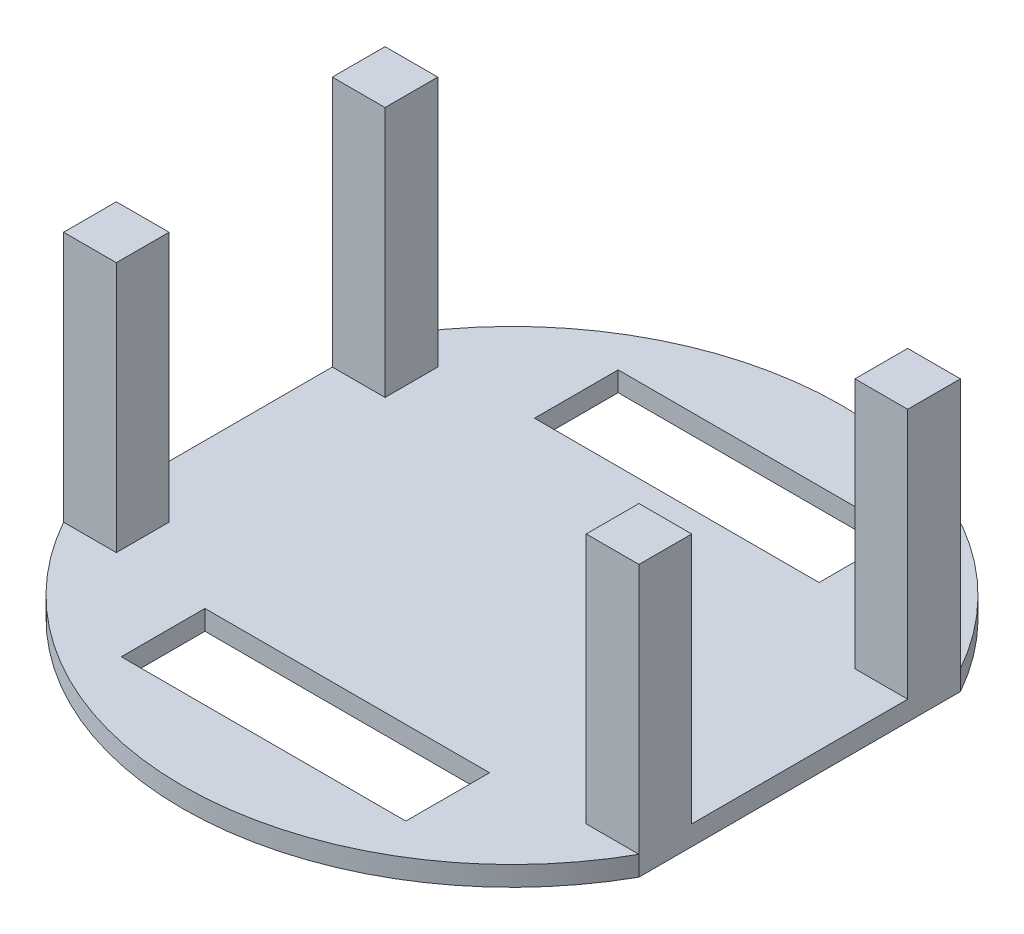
ISO-10303-21;
HEADER;
FILE_DESCRIPTION(('STEP AP214'),'2;1');
FILE_NAME('part.step','',(''),(''),'','','');
FILE_SCHEMA(('AUTOMOTIVE_DESIGN { 1 0 10303 214 1 1 1 1 }'));
ENDSEC;
DATA;
#1=APPLICATION_CONTEXT('core data for automotive mechanical design processes');
#2=APPLICATION_PROTOCOL_DEFINITION('international standard','automotive_design',2000,#1);
#3=PRODUCT_CONTEXT('',#1,'mechanical');
#4=PRODUCT('Part','Part','',(#3));
#5=PRODUCT_RELATED_PRODUCT_CATEGORY('part','',(#4));
#6=PRODUCT_DEFINITION_FORMATION('','',#4);
#7=PRODUCT_DEFINITION_CONTEXT('part definition',#1,'design');
#8=PRODUCT_DEFINITION('design','',#6,#7);
#9=PRODUCT_DEFINITION_SHAPE('','',#8);
#10=(LENGTH_UNIT() NAMED_UNIT(*) SI_UNIT(.MILLI.,.METRE.));
#11=(NAMED_UNIT(*) PLANE_ANGLE_UNIT() SI_UNIT($,.RADIAN.));
#12=(NAMED_UNIT(*) SI_UNIT($,.STERADIAN.) SOLID_ANGLE_UNIT());
#13=UNCERTAINTY_MEASURE_WITH_UNIT(LENGTH_MEASURE(1.E-05),#10,'distance_accuracy_value','');
#14=(GEOMETRIC_REPRESENTATION_CONTEXT(3) GLOBAL_UNCERTAINTY_ASSIGNED_CONTEXT((#13)) GLOBAL_UNIT_ASSIGNED_CONTEXT((#10,
#11,#12)) REPRESENTATION_CONTEXT('',''));
#15=CARTESIAN_POINT('',(0.,0.,0.));
#16=DIRECTION('',(0.,0.,1.));
#17=DIRECTION('',(1.,0.,0.));
#18=AXIS2_PLACEMENT_3D('',#15,#16,#17);
#19=CARTESIAN_POINT('',(0.,3.,0.));
#20=DIRECTION('',(0.,1.,0.));
#21=DIRECTION('',(0.,0.,1.));
#22=AXIS2_PLACEMENT_3D('',#19,#20,#21);
#23=PLANE('',#22);
#24=DIRECTION('',(1.,0.,0.));
#25=VECTOR('',#24,1.);
#26=CARTESIAN_POINT('',(0.,3.,25.));
#27=LINE('',#26,#25);
#28=CARTESIAN_POINT('',(-21.59,3.,25.));
#29=VERTEX_POINT('',#28);
#30=CARTESIAN_POINT('',(21.59,3.,25.));
#31=VERTEX_POINT('',#30);
#32=EDGE_CURVE('E223',#29,#31,#27,.T.);
#33=ORIENTED_EDGE('',*,*,#32,.T.);
#34=DIRECTION('',(0.,0.,1.));
#35=VECTOR('',#34,1.);
#36=CARTESIAN_POINT('',(21.59,3.,25.));
#37=LINE('',#36,#35);
#38=CARTESIAN_POINT('',(21.59,3.,37.7));
#39=VERTEX_POINT('',#38);
#40=EDGE_CURVE('E210',#31,#39,#37,.T.);
#41=ORIENTED_EDGE('',*,*,#40,.T.);
#42=DIRECTION('',(-1.,0.,0.));
#43=VECTOR('',#42,1.);
#44=CARTESIAN_POINT('',(21.59,3.,37.7));
#45=LINE('',#44,#43);
#46=CARTESIAN_POINT('',(-21.59,3.,37.7));
#47=VERTEX_POINT('',#46);
#48=EDGE_CURVE('E240',#39,#47,#45,.T.);
#49=ORIENTED_EDGE('',*,*,#48,.T.);
#50=DIRECTION('',(0.,0.,-1.));
#51=VECTOR('',#50,1.);
#52=CARTESIAN_POINT('',(-21.59,3.,37.7));
#53=LINE('',#52,#51);
#54=EDGE_CURVE('E230',#47,#29,#53,.T.);
#55=ORIENTED_EDGE('',*,*,#54,.T.);
#56=EDGE_LOOP('',(#33,#41,#49,#55));
#57=FACE_BOUND('',#56,.T.);
#58=DIRECTION('',(0.,0.,-1.));
#59=VECTOR('',#58,1.);
#60=CARTESIAN_POINT('',(-21.59,3.,-37.7));
#61=LINE('',#60,#59);
#62=CARTESIAN_POINT('',(-21.59,3.,-25.));
#63=VERTEX_POINT('',#62);
#64=CARTESIAN_POINT('',(-21.59,3.,-37.7));
#65=VERTEX_POINT('',#64);
#66=EDGE_CURVE('E252',#63,#65,#61,.T.);
#67=ORIENTED_EDGE('',*,*,#66,.T.);
#68=DIRECTION('',(1.,0.,0.));
#69=VECTOR('',#68,1.);
#70=CARTESIAN_POINT('',(21.59,3.,-37.7));
#71=LINE('',#70,#69);
#72=CARTESIAN_POINT('',(21.59,3.,-37.7));
#73=VERTEX_POINT('',#72);
#74=EDGE_CURVE('E269',#65,#73,#71,.T.);
#75=ORIENTED_EDGE('',*,*,#74,.T.);
#76=DIRECTION('',(0.,0.,1.));
#77=VECTOR('',#76,1.);
#78=CARTESIAN_POINT('',(21.59,3.,-25.));
#79=LINE('',#78,#77);
#80=CARTESIAN_POINT('',(21.59,3.,-25.));
#81=VERTEX_POINT('',#80);
#82=EDGE_CURVE('E265',#73,#81,#79,.T.);
#83=ORIENTED_EDGE('',*,*,#82,.T.);
#84=DIRECTION('',(-1.,0.,0.));
#85=VECTOR('',#84,1.);
#86=CARTESIAN_POINT('',(0.,3.,-25.));
#87=LINE('',#86,#85);
#88=EDGE_CURVE('E261',#81,#63,#87,.T.);
#89=ORIENTED_EDGE('',*,*,#88,.T.);
#90=EDGE_LOOP('',(#67,#75,#83,#89));
#91=FACE_BOUND('',#90,.T.);
#92=DIRECTION('',(0.,0.,-1.));
#93=VECTOR('',#92,1.);
#94=CARTESIAN_POINT('',(-35.65,3.,24.3860103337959));
#95=LINE('',#94,#93);
#96=CARTESIAN_POINT('',(-35.65,3.,24.3860103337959));
#97=VERTEX_POINT('',#96);
#98=CARTESIAN_POINT('',(-35.65,3.,16.3860103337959));
#99=VERTEX_POINT('',#98);
#100=EDGE_CURVE('E290',#97,#99,#95,.T.);
#101=ORIENTED_EDGE('',*,*,#100,.F.);
#102=DIRECTION('',(1.,0.,0.));
#103=VECTOR('',#102,1.);
#104=CARTESIAN_POINT('',(-43.65,3.,24.3860103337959));
#105=LINE('',#104,#103);
#106=CARTESIAN_POINT('',(-43.65,3.,24.3860103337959));
#107=VERTEX_POINT('',#106);
#108=EDGE_CURVE('E288',#107,#97,#105,.T.);
#109=ORIENTED_EDGE('',*,*,#108,.F.);
#110=CARTESIAN_POINT('',(0.,3.,0.));
#111=DIRECTION('',(0.,1.,0.));
#112=DIRECTION('',(0.,0.,1.));
#113=AXIS2_PLACEMENT_3D('',#110,#111,#112);
#114=CIRCLE('',#113,50.);
#115=CARTESIAN_POINT('',(43.65,3.,24.3860103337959));
#116=VERTEX_POINT('',#115);
#117=EDGE_CURVE('E406',#107,#116,#114,.T.);
#118=ORIENTED_EDGE('',*,*,#117,.T.);
#119=DIRECTION('',(-1.,0.,0.));
#120=VECTOR('',#119,1.);
#121=CARTESIAN_POINT('',(43.65,3.,24.3860103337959));
#122=LINE('',#121,#120);
#123=CARTESIAN_POINT('',(35.65,3.,24.3860103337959));
#124=VERTEX_POINT('',#123);
#125=EDGE_CURVE('E322',#116,#124,#122,.T.);
#126=ORIENTED_EDGE('',*,*,#125,.T.);
#127=DIRECTION('',(0.,0.,-1.));
#128=VECTOR('',#127,1.);
#129=CARTESIAN_POINT('',(35.65,3.,24.3860103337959));
#130=LINE('',#129,#128);
#131=CARTESIAN_POINT('',(35.65,3.,16.3860103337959));
#132=VERTEX_POINT('',#131);
#133=EDGE_CURVE('E318',#124,#132,#130,.T.);
#134=ORIENTED_EDGE('',*,*,#133,.T.);
#135=DIRECTION('',(-1.,0.,0.));
#136=VECTOR('',#135,1.);
#137=CARTESIAN_POINT('',(43.65,3.,16.3860103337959));
#138=LINE('',#137,#136);
#139=CARTESIAN_POINT('',(43.65,3.,16.3860103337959));
#140=VERTEX_POINT('',#139);
#141=EDGE_CURVE('E315',#140,#132,#138,.T.);
#142=ORIENTED_EDGE('',*,*,#141,.F.);
#143=DIRECTION('',(0.,0.,1.));
#144=VECTOR('',#143,1.);
#145=CARTESIAN_POINT('',(43.65,3.,41.6852732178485));
#146=LINE('',#145,#144);
#147=CARTESIAN_POINT('',(43.65,3.,-16.3860103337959));
#148=VERTEX_POINT('',#147);
#149=EDGE_CURVE('E389',#148,#140,#146,.T.);
#150=ORIENTED_EDGE('',*,*,#149,.F.);
#151=DIRECTION('',(1.,0.,0.));
#152=VECTOR('',#151,1.);
#153=CARTESIAN_POINT('',(0.,3.,-16.3860103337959));
#154=LINE('',#153,#152);
#155=CARTESIAN_POINT('',(35.65,3.,-16.3860103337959));
#156=VERTEX_POINT('',#155);
#157=EDGE_CURVE('E343',#156,#148,#154,.T.);
#158=ORIENTED_EDGE('',*,*,#157,.F.);
#159=DIRECTION('',(0.,0.,1.));
#160=VECTOR('',#159,1.);
#161=CARTESIAN_POINT('',(35.65,3.,0.));
#162=LINE('',#161,#160);
#163=CARTESIAN_POINT('',(35.65,3.,-24.3860103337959));
#164=VERTEX_POINT('',#163);
#165=EDGE_CURVE('E346',#164,#156,#162,.T.);
#166=ORIENTED_EDGE('',*,*,#165,.F.);
#167=DIRECTION('',(-1.,0.,0.));
#168=VECTOR('',#167,1.);
#169=CARTESIAN_POINT('',(0.,3.,-24.3860103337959));
#170=LINE('',#169,#168);
#171=CARTESIAN_POINT('',(43.65,3.,-24.3860103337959));
#172=VERTEX_POINT('',#171);
#173=EDGE_CURVE('E349',#172,#164,#170,.T.);
#174=ORIENTED_EDGE('',*,*,#173,.F.);
#175=CARTESIAN_POINT('',(-43.65,3.,-24.3860103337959));
#176=VERTEX_POINT('',#175);
#177=EDGE_CURVE('E409',#172,#176,#114,.T.);
#178=ORIENTED_EDGE('',*,*,#177,.T.);
#179=DIRECTION('',(1.,0.,0.));
#180=VECTOR('',#179,1.);
#181=CARTESIAN_POINT('',(0.,3.,-24.3860103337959));
#182=LINE('',#181,#180);
#183=CARTESIAN_POINT('',(-35.65,3.,-24.3860103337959));
#184=VERTEX_POINT('',#183);
#185=EDGE_CURVE('E374',#176,#184,#182,.T.);
#186=ORIENTED_EDGE('',*,*,#185,.T.);
#187=DIRECTION('',(0.,0.,1.));
#188=VECTOR('',#187,1.);
#189=CARTESIAN_POINT('',(-35.65,3.,0.));
#190=LINE('',#189,#188);
#191=CARTESIAN_POINT('',(-35.65,3.,-16.3860103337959));
#192=VERTEX_POINT('',#191);
#193=EDGE_CURVE('E352',#184,#192,#190,.T.);
#194=ORIENTED_EDGE('',*,*,#193,.T.);
#195=DIRECTION('',(1.,0.,0.));
#196=VECTOR('',#195,1.);
#197=CARTESIAN_POINT('',(0.,3.,-16.3860103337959));
#198=LINE('',#197,#196);
#199=CARTESIAN_POINT('',(-43.65,3.,-16.3860103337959));
#200=VERTEX_POINT('',#199);
#201=EDGE_CURVE('E364',#200,#192,#198,.T.);
#202=ORIENTED_EDGE('',*,*,#201,.F.);
#203=DIRECTION('',(0.,0.,-1.));
#204=VECTOR('',#203,1.);
#205=CARTESIAN_POINT('',(-43.65,3.,0.));
#206=LINE('',#205,#204);
#207=CARTESIAN_POINT('',(-43.65,3.,16.3860103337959));
#208=VERTEX_POINT('',#207);
#209=EDGE_CURVE('E388',#208,#200,#206,.T.);
#210=ORIENTED_EDGE('',*,*,#209,.F.);
#211=DIRECTION('',(1.,0.,0.));
#212=VECTOR('',#211,1.);
#213=CARTESIAN_POINT('',(-43.65,3.,16.3860103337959));
#214=LINE('',#213,#212);
#215=EDGE_CURVE('E294',#208,#99,#214,.T.);
#216=ORIENTED_EDGE('',*,*,#215,.T.);
#217=EDGE_LOOP('',(#101,#109,#118,#126,#134,#142,#150,#158,#166,#174,#178,#186,#194,#202,#210,#216));
#218=FACE_BOUND('',#217,.T.);
#219=ADVANCED_FACE('F37',(#57,#91,#218),#23,.T.);
#220=CARTESIAN_POINT('',(0.,3.,0.));
#221=DIRECTION('',(0.,-1.,0.));
#222=DIRECTION('',(0.,0.,-1.));
#223=AXIS2_PLACEMENT_3D('',#220,#221,#222);
#224=CYLINDRICAL_SURFACE('',#223,50.);
#225=ORIENTED_EDGE('',*,*,#177,.F.);
#226=DIRECTION('',(0.,-1.,0.));
#227=VECTOR('',#226,1.);
#228=CARTESIAN_POINT('',(43.65,3.,-24.3860103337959));
#229=LINE('',#228,#227);
#230=CARTESIAN_POINT('',(43.65,0.,-24.3860103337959));
#231=VERTEX_POINT('',#230);
#232=EDGE_CURVE('E402',#172,#231,#229,.T.);
#233=ORIENTED_EDGE('',*,*,#232,.T.);
#234=CARTESIAN_POINT('',(0.,0.,0.));
#235=DIRECTION('',(0.,1.,0.));
#236=DIRECTION('',(0.,0.,1.));
#237=AXIS2_PLACEMENT_3D('',#234,#235,#236);
#238=CIRCLE('',#237,50.);
#239=CARTESIAN_POINT('',(-43.65,0.,-24.3860103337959));
#240=VERTEX_POINT('',#239);
#241=EDGE_CURVE('E410',#231,#240,#238,.T.);
#242=ORIENTED_EDGE('',*,*,#241,.T.);
#243=DIRECTION('',(0.,-1.,0.));
#244=VECTOR('',#243,1.);
#245=CARTESIAN_POINT('',(-43.65,3.,-24.3860103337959));
#246=LINE('',#245,#244);
#247=EDGE_CURVE('E392',#240,#176,#246,.F.);
#248=ORIENTED_EDGE('',*,*,#247,.T.);
#249=EDGE_LOOP('',(#225,#233,#242,#248));
#250=FACE_BOUND('',#249,.T.);
#251=ADVANCED_FACE('F426',(#250),#224,.T.);
#252=CARTESIAN_POINT('',(-43.65,0.,24.3860103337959));
#253=VERTEX_POINT('',#252);
#254=CARTESIAN_POINT('',(43.65,0.,24.3860103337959));
#255=VERTEX_POINT('',#254);
#256=EDGE_CURVE('E405',#253,#255,#238,.T.);
#257=ORIENTED_EDGE('',*,*,#256,.T.);
#258=DIRECTION('',(0.,-1.,0.));
#259=VECTOR('',#258,1.);
#260=CARTESIAN_POINT('',(43.65,3.,24.3860103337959));
#261=LINE('',#260,#259);
#262=EDGE_CURVE('E399',#255,#116,#261,.F.);
#263=ORIENTED_EDGE('',*,*,#262,.T.);
#264=ORIENTED_EDGE('',*,*,#117,.F.);
#265=DIRECTION('',(0.,-1.,0.));
#266=VECTOR('',#265,1.);
#267=CARTESIAN_POINT('',(-43.65,3.,24.3860103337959));
#268=LINE('',#267,#266);
#269=EDGE_CURVE('E396',#107,#253,#268,.T.);
#270=ORIENTED_EDGE('',*,*,#269,.T.);
#271=EDGE_LOOP('',(#257,#263,#264,#270));
#272=FACE_BOUND('',#271,.T.);
#273=ADVANCED_FACE('F39',(#272),#224,.T.);
#274=CARTESIAN_POINT('',(0.,0.,0.));
#275=DIRECTION('',(0.,1.,0.));
#276=DIRECTION('',(0.,0.,1.));
#277=AXIS2_PLACEMENT_3D('',#274,#275,#276);
#278=PLANE('',#277);
#279=DIRECTION('',(0.,0.,1.));
#280=VECTOR('',#279,1.);
#281=CARTESIAN_POINT('',(21.59,0.,25.));
#282=LINE('',#281,#280);
#283=CARTESIAN_POINT('',(21.59,0.,25.));
#284=VERTEX_POINT('',#283);
#285=CARTESIAN_POINT('',(21.59,0.,37.7));
#286=VERTEX_POINT('',#285);
#287=EDGE_CURVE('E233',#284,#286,#282,.T.);
#288=ORIENTED_EDGE('',*,*,#287,.F.);
#289=DIRECTION('',(1.,0.,0.));
#290=VECTOR('',#289,1.);
#291=CARTESIAN_POINT('',(0.,0.,25.));
#292=LINE('',#291,#290);
#293=CARTESIAN_POINT('',(-21.59,0.,25.));
#294=VERTEX_POINT('',#293);
#295=EDGE_CURVE('E226',#294,#284,#292,.T.);
#296=ORIENTED_EDGE('',*,*,#295,.F.);
#297=DIRECTION('',(0.,0.,-1.));
#298=VECTOR('',#297,1.);
#299=CARTESIAN_POINT('',(-21.59,0.,37.7));
#300=LINE('',#299,#298);
#301=CARTESIAN_POINT('',(-21.59,0.,37.7));
#302=VERTEX_POINT('',#301);
#303=EDGE_CURVE('E277',#302,#294,#300,.T.);
#304=ORIENTED_EDGE('',*,*,#303,.F.);
#305=DIRECTION('',(-1.,0.,0.));
#306=VECTOR('',#305,1.);
#307=CARTESIAN_POINT('',(21.59,0.,37.7));
#308=LINE('',#307,#306);
#309=EDGE_CURVE('E231',#286,#302,#308,.T.);
#310=ORIENTED_EDGE('',*,*,#309,.F.);
#311=EDGE_LOOP('',(#288,#296,#304,#310));
#312=FACE_BOUND('',#311,.T.);
#313=DIRECTION('',(1.,0.,0.));
#314=VECTOR('',#313,1.);
#315=CARTESIAN_POINT('',(21.59,0.,-37.7));
#316=LINE('',#315,#314);
#317=CARTESIAN_POINT('',(-21.59,0.,-37.7));
#318=VERTEX_POINT('',#317);
#319=CARTESIAN_POINT('',(21.59,0.,-37.7));
#320=VERTEX_POINT('',#319);
#321=EDGE_CURVE('E253',#318,#320,#316,.T.);
#322=ORIENTED_EDGE('',*,*,#321,.F.);
#323=DIRECTION('',(0.,0.,-1.));
#324=VECTOR('',#323,1.);
#325=CARTESIAN_POINT('',(-21.59,0.,-37.7));
#326=LINE('',#325,#324);
#327=CARTESIAN_POINT('',(-21.59,0.,-25.));
#328=VERTEX_POINT('',#327);
#329=EDGE_CURVE('E249',#328,#318,#326,.T.);
#330=ORIENTED_EDGE('',*,*,#329,.F.);
#331=DIRECTION('',(-1.,0.,0.));
#332=VECTOR('',#331,1.);
#333=CARTESIAN_POINT('',(0.,0.,-25.));
#334=LINE('',#333,#332);
#335=CARTESIAN_POINT('',(21.59,0.,-25.));
#336=VERTEX_POINT('',#335);
#337=EDGE_CURVE('E247',#336,#328,#334,.T.);
#338=ORIENTED_EDGE('',*,*,#337,.F.);
#339=DIRECTION('',(0.,0.,1.));
#340=VECTOR('',#339,1.);
#341=CARTESIAN_POINT('',(21.59,0.,-25.));
#342=LINE('',#341,#340);
#343=EDGE_CURVE('E250',#320,#336,#342,.T.);
#344=ORIENTED_EDGE('',*,*,#343,.F.);
#345=EDGE_LOOP('',(#322,#330,#338,#344));
#346=FACE_BOUND('',#345,.T.);
#347=ORIENTED_EDGE('',*,*,#241,.F.);
#348=DIRECTION('',(0.,0.,1.));
#349=VECTOR('',#348,1.);
#350=CARTESIAN_POINT('',(43.65,0.,0.));
#351=LINE('',#350,#349);
#352=EDGE_CURVE('E11',#231,#255,#351,.T.);
#353=ORIENTED_EDGE('',*,*,#352,.T.);
#354=ORIENTED_EDGE('',*,*,#256,.F.);
#355=DIRECTION('',(0.,0.,-1.));
#356=VECTOR('',#355,1.);
#357=CARTESIAN_POINT('',(-43.65,0.,0.));
#358=LINE('',#357,#356);
#359=EDGE_CURVE('E45',#253,#240,#358,.T.);
#360=ORIENTED_EDGE('',*,*,#359,.T.);
#361=EDGE_LOOP('',(#347,#353,#354,#360));
#362=FACE_BOUND('',#361,.T.);
#363=ADVANCED_FACE('F465',(#312,#346,#362),#278,.F.);
#364=CARTESIAN_POINT('',(-43.65,-101.379189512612,0.));
#365=DIRECTION('',(1.,0.,0.));
#366=DIRECTION('',(0.,0.,-1.));
#367=AXIS2_PLACEMENT_3D('',#364,#365,#366);
#368=PLANE('',#367);
#369=ORIENTED_EDGE('',*,*,#269,.F.);
#370=DIRECTION('',(0.,-1.,0.));
#371=VECTOR('',#370,1.);
#372=CARTESIAN_POINT('',(-43.65,41.1,24.3860103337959));
#373=LINE('',#372,#371);
#374=CARTESIAN_POINT('',(-43.65,41.1,24.3860103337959));
#375=VERTEX_POINT('',#374);
#376=EDGE_CURVE('E243',#375,#107,#373,.T.);
#377=ORIENTED_EDGE('',*,*,#376,.F.);
#378=DIRECTION('',(0.,0.,-1.));
#379=VECTOR('',#378,1.);
#380=CARTESIAN_POINT('',(-43.65,41.1,24.3860103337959));
#381=LINE('',#380,#379);
#382=CARTESIAN_POINT('',(-43.65,41.1,16.3860103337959));
#383=VERTEX_POINT('',#382);
#384=EDGE_CURVE('E291',#375,#383,#381,.T.);
#385=ORIENTED_EDGE('',*,*,#384,.T.);
#386=DIRECTION('',(0.,-1.,0.));
#387=VECTOR('',#386,1.);
#388=CARTESIAN_POINT('',(-43.65,41.1,16.3860103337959));
#389=LINE('',#388,#387);
#390=EDGE_CURVE('E278',#383,#208,#389,.T.);
#391=ORIENTED_EDGE('',*,*,#390,.T.);
#392=ORIENTED_EDGE('',*,*,#209,.T.);
#393=DIRECTION('',(0.,-1.,0.));
#394=VECTOR('',#393,1.);
#395=CARTESIAN_POINT('',(-43.65,41.1,-16.3860103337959));
#396=LINE('',#395,#394);
#397=CARTESIAN_POINT('',(-43.65,41.1,-16.3860103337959));
#398=VERTEX_POINT('',#397);
#399=EDGE_CURVE('E380',#398,#200,#396,.T.);
#400=ORIENTED_EDGE('',*,*,#399,.F.);
#401=DIRECTION('',(0.,0.,1.));
#402=VECTOR('',#401,1.);
#403=CARTESIAN_POINT('',(-43.65,41.1,0.));
#404=LINE('',#403,#402);
#405=CARTESIAN_POINT('',(-43.65,41.1,-24.3860103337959));
#406=VERTEX_POINT('',#405);
#407=EDGE_CURVE('E367',#406,#398,#404,.T.);
#408=ORIENTED_EDGE('',*,*,#407,.F.);
#409=DIRECTION('',(0.,-1.,0.));
#410=VECTOR('',#409,1.);
#411=CARTESIAN_POINT('',(-43.65,41.1,-24.3860103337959));
#412=LINE('',#411,#410);
#413=EDGE_CURVE('E383',#406,#176,#412,.T.);
#414=ORIENTED_EDGE('',*,*,#413,.T.);
#415=ORIENTED_EDGE('',*,*,#247,.F.);
#416=ORIENTED_EDGE('',*,*,#359,.F.);
#417=EDGE_LOOP('',(#369,#377,#385,#391,#392,#400,#408,#414,#415,#416));
#418=FACE_BOUND('',#417,.T.);
#419=ADVANCED_FACE('F429',(#418),#368,.F.);
#420=CARTESIAN_POINT('',(43.65,-101.379189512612,41.6852732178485));
#421=DIRECTION('',(-1.,0.,0.));
#422=DIRECTION('',(0.,0.,1.));
#423=AXIS2_PLACEMENT_3D('',#420,#421,#422);
#424=PLANE('',#423);
#425=ORIENTED_EDGE('',*,*,#232,.F.);
#426=DIRECTION('',(0.,-1.,0.));
#427=VECTOR('',#426,1.);
#428=CARTESIAN_POINT('',(43.65,41.1,-24.3860103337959));
#429=LINE('',#428,#427);
#430=CARTESIAN_POINT('',(43.65,41.1,-24.3860103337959));
#431=VERTEX_POINT('',#430);
#432=EDGE_CURVE('E340',#431,#172,#429,.T.);
#433=ORIENTED_EDGE('',*,*,#432,.F.);
#434=DIRECTION('',(0.,0.,-1.));
#435=VECTOR('',#434,1.);
#436=CARTESIAN_POINT('',(43.65,41.1,0.));
#437=LINE('',#436,#435);
#438=CARTESIAN_POINT('',(43.65,41.1,-16.3860103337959));
#439=VERTEX_POINT('',#438);
#440=EDGE_CURVE('E342',#439,#431,#437,.T.);
#441=ORIENTED_EDGE('',*,*,#440,.F.);
#442=DIRECTION('',(0.,-1.,0.));
#443=VECTOR('',#442,1.);
#444=CARTESIAN_POINT('',(43.65,41.1,-16.3860103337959));
#445=LINE('',#444,#443);
#446=EDGE_CURVE('E338',#439,#148,#445,.T.);
#447=ORIENTED_EDGE('',*,*,#446,.T.);
#448=ORIENTED_EDGE('',*,*,#149,.T.);
#449=DIRECTION('',(0.,-1.,0.));
#450=VECTOR('',#449,1.);
#451=CARTESIAN_POINT('',(43.65,41.1,16.3860103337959));
#452=LINE('',#451,#450);
#453=CARTESIAN_POINT('',(43.65,41.1,16.3860103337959));
#454=VERTEX_POINT('',#453);
#455=EDGE_CURVE('E311',#454,#140,#452,.T.);
#456=ORIENTED_EDGE('',*,*,#455,.F.);
#457=DIRECTION('',(0.,0.,-1.));
#458=VECTOR('',#457,1.);
#459=CARTESIAN_POINT('',(43.65,41.1,24.3860103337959));
#460=LINE('',#459,#458);
#461=CARTESIAN_POINT('',(43.65,41.1,24.3860103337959));
#462=VERTEX_POINT('',#461);
#463=EDGE_CURVE('E308',#462,#454,#460,.T.);
#464=ORIENTED_EDGE('',*,*,#463,.F.);
#465=DIRECTION('',(0.,-1.,0.));
#466=VECTOR('',#465,1.);
#467=CARTESIAN_POINT('',(43.65,41.1,24.3860103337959));
#468=LINE('',#467,#466);
#469=EDGE_CURVE('E297',#462,#116,#468,.T.);
#470=ORIENTED_EDGE('',*,*,#469,.T.);
#471=ORIENTED_EDGE('',*,*,#262,.F.);
#472=ORIENTED_EDGE('',*,*,#352,.F.);
#473=EDGE_LOOP('',(#425,#433,#441,#447,#448,#456,#464,#470,#471,#472));
#474=FACE_BOUND('',#473,.T.);
#475=ADVANCED_FACE('F463',(#474),#424,.F.);
#476=CARTESIAN_POINT('',(-35.65,41.1,0.));
#477=DIRECTION('',(1.,0.,0.));
#478=DIRECTION('',(0.,0.,-1.));
#479=AXIS2_PLACEMENT_3D('',#476,#477,#478);
#480=PLANE('',#479);
#481=ORIENTED_EDGE('',*,*,#193,.F.);
#482=DIRECTION('',(0.,-1.,0.));
#483=VECTOR('',#482,1.);
#484=CARTESIAN_POINT('',(-35.65,41.1,-24.3860103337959));
#485=LINE('',#484,#483);
#486=CARTESIAN_POINT('',(-35.65,41.1,-24.3860103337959));
#487=VERTEX_POINT('',#486);
#488=EDGE_CURVE('E385',#487,#184,#485,.T.);
#489=ORIENTED_EDGE('',*,*,#488,.F.);
#490=DIRECTION('',(0.,0.,1.));
#491=VECTOR('',#490,1.);
#492=CARTESIAN_POINT('',(-35.65,41.1,0.));
#493=LINE('',#492,#491);
#494=CARTESIAN_POINT('',(-35.65,41.1,-16.3860103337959));
#495=VERTEX_POINT('',#494);
#496=EDGE_CURVE('E360',#487,#495,#493,.T.);
#497=ORIENTED_EDGE('',*,*,#496,.T.);
#498=DIRECTION('',(0.,-1.,0.));
#499=VECTOR('',#498,1.);
#500=CARTESIAN_POINT('',(-35.65,41.1,-16.3860103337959));
#501=LINE('',#500,#499);
#502=EDGE_CURVE('E371',#495,#192,#501,.T.);
#503=ORIENTED_EDGE('',*,*,#502,.T.);
#504=EDGE_LOOP('',(#481,#489,#497,#503));
#505=FACE_BOUND('',#504,.T.);
#506=ADVANCED_FACE('F437',(#505),#480,.T.);
#507=CARTESIAN_POINT('',(0.,41.1,-24.3860103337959));
#508=DIRECTION('',(0.,0.,-1.));
#509=DIRECTION('',(-1.,0.,0.));
#510=AXIS2_PLACEMENT_3D('',#507,#508,#509);
#511=PLANE('',#510);
#512=ORIENTED_EDGE('',*,*,#185,.F.);
#513=ORIENTED_EDGE('',*,*,#413,.F.);
#514=DIRECTION('',(1.,0.,0.));
#515=VECTOR('',#514,1.);
#516=CARTESIAN_POINT('',(0.,41.1,-24.3860103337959));
#517=LINE('',#516,#515);
#518=EDGE_CURVE('E363',#406,#487,#517,.T.);
#519=ORIENTED_EDGE('',*,*,#518,.T.);
#520=ORIENTED_EDGE('',*,*,#488,.T.);
#521=EDGE_LOOP('',(#512,#513,#519,#520));
#522=FACE_BOUND('',#521,.T.);
#523=ADVANCED_FACE('F434',(#522),#511,.T.);
#524=CARTESIAN_POINT('',(0.,41.1,-16.3860103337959));
#525=DIRECTION('',(0.,0.,-1.));
#526=DIRECTION('',(-1.,0.,0.));
#527=AXIS2_PLACEMENT_3D('',#524,#525,#526);
#528=PLANE('',#527);
#529=ORIENTED_EDGE('',*,*,#201,.T.);
#530=ORIENTED_EDGE('',*,*,#502,.F.);
#531=DIRECTION('',(1.,0.,0.));
#532=VECTOR('',#531,1.);
#533=CARTESIAN_POINT('',(0.,41.1,-16.3860103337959));
#534=LINE('',#533,#532);
#535=EDGE_CURVE('E369',#398,#495,#534,.T.);
#536=ORIENTED_EDGE('',*,*,#535,.F.);
#537=ORIENTED_EDGE('',*,*,#399,.T.);
#538=EDGE_LOOP('',(#529,#530,#536,#537));
#539=FACE_BOUND('',#538,.T.);
#540=ADVANCED_FACE('F443',(#539),#528,.F.);
#541=CARTESIAN_POINT('',(0.,41.1,0.));
#542=DIRECTION('',(0.,1.,0.));
#543=DIRECTION('',(0.,0.,1.));
#544=AXIS2_PLACEMENT_3D('',#541,#542,#543);
#545=PLANE('',#544);
#546=ORIENTED_EDGE('',*,*,#496,.F.);
#547=ORIENTED_EDGE('',*,*,#518,.F.);
#548=ORIENTED_EDGE('',*,*,#407,.T.);
#549=ORIENTED_EDGE('',*,*,#535,.T.);
#550=EDGE_LOOP('',(#546,#547,#548,#549));
#551=FACE_BOUND('',#550,.T.);
#552=ADVANCED_FACE('F439',(#551),#545,.T.);
#553=CARTESIAN_POINT('',(0.,41.1,-24.3860103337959));
#554=DIRECTION('',(0.,0.,1.));
#555=DIRECTION('',(1.,0.,0.));
#556=AXIS2_PLACEMENT_3D('',#553,#554,#555);
#557=PLANE('',#556);
#558=ORIENTED_EDGE('',*,*,#173,.T.);
#559=DIRECTION('',(0.,-1.,0.));
#560=VECTOR('',#559,1.);
#561=CARTESIAN_POINT('',(35.65,41.1,-24.3860103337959));
#562=LINE('',#561,#560);
#563=CARTESIAN_POINT('',(35.65,41.1,-24.3860103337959));
#564=VERTEX_POINT('',#563);
#565=EDGE_CURVE('E325',#564,#164,#562,.T.);
#566=ORIENTED_EDGE('',*,*,#565,.F.);
#567=DIRECTION('',(-1.,0.,0.));
#568=VECTOR('',#567,1.);
#569=CARTESIAN_POINT('',(0.,41.1,-24.3860103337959));
#570=LINE('',#569,#568);
#571=EDGE_CURVE('E347',#431,#564,#570,.T.);
#572=ORIENTED_EDGE('',*,*,#571,.F.);
#573=ORIENTED_EDGE('',*,*,#432,.T.);
#574=EDGE_LOOP('',(#558,#566,#572,#573));
#575=FACE_BOUND('',#574,.T.);
#576=ADVANCED_FACE('F492',(#575),#557,.F.);
#577=CARTESIAN_POINT('',(35.65,41.1,0.));
#578=DIRECTION('',(1.,0.,0.));
#579=DIRECTION('',(0.,0.,-1.));
#580=AXIS2_PLACEMENT_3D('',#577,#578,#579);
#581=PLANE('',#580);
#582=ORIENTED_EDGE('',*,*,#165,.T.);
#583=DIRECTION('',(0.,-1.,0.));
#584=VECTOR('',#583,1.);
#585=CARTESIAN_POINT('',(35.65,41.1,-16.3860103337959));
#586=LINE('',#585,#584);
#587=CARTESIAN_POINT('',(35.65,41.1,-16.3860103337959));
#588=VERTEX_POINT('',#587);
#589=EDGE_CURVE('E335',#588,#156,#586,.T.);
#590=ORIENTED_EDGE('',*,*,#589,.F.);
#591=DIRECTION('',(0.,0.,1.));
#592=VECTOR('',#591,1.);
#593=CARTESIAN_POINT('',(35.65,41.1,0.));
#594=LINE('',#593,#592);
#595=EDGE_CURVE('E356',#564,#588,#594,.T.);
#596=ORIENTED_EDGE('',*,*,#595,.F.);
#597=ORIENTED_EDGE('',*,*,#565,.T.);
#598=EDGE_LOOP('',(#582,#590,#596,#597));
#599=FACE_BOUND('',#598,.T.);
#600=ADVANCED_FACE('F501',(#599),#581,.F.);
#601=CARTESIAN_POINT('',(0.,41.1,-16.3860103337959));
#602=DIRECTION('',(0.,0.,-1.));
#603=DIRECTION('',(-1.,0.,0.));
#604=AXIS2_PLACEMENT_3D('',#601,#602,#603);
#605=PLANE('',#604);
#606=ORIENTED_EDGE('',*,*,#157,.T.);
#607=ORIENTED_EDGE('',*,*,#446,.F.);
#608=DIRECTION('',(1.,0.,0.));
#609=VECTOR('',#608,1.);
#610=CARTESIAN_POINT('',(0.,41.1,-16.3860103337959));
#611=LINE('',#610,#609);
#612=EDGE_CURVE('E354',#588,#439,#611,.T.);
#613=ORIENTED_EDGE('',*,*,#612,.F.);
#614=ORIENTED_EDGE('',*,*,#589,.T.);
#615=EDGE_LOOP('',(#606,#607,#613,#614));
#616=FACE_BOUND('',#615,.T.);
#617=ADVANCED_FACE('F497',(#616),#605,.F.);
#618=CARTESIAN_POINT('',(0.,41.1,0.));
#619=DIRECTION('',(0.,1.,0.));
#620=DIRECTION('',(0.,0.,1.));
#621=AXIS2_PLACEMENT_3D('',#618,#619,#620);
#622=PLANE('',#621);
#623=ORIENTED_EDGE('',*,*,#571,.T.);
#624=ORIENTED_EDGE('',*,*,#595,.T.);
#625=ORIENTED_EDGE('',*,*,#612,.T.);
#626=ORIENTED_EDGE('',*,*,#440,.T.);
#627=EDGE_LOOP('',(#623,#624,#625,#626));
#628=FACE_BOUND('',#627,.T.);
#629=ADVANCED_FACE('F493',(#628),#622,.T.);
#630=CARTESIAN_POINT('',(43.65,41.1,24.3860103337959));
#631=DIRECTION('',(0.,0.,1.));
#632=DIRECTION('',(1.,0.,0.));
#633=AXIS2_PLACEMENT_3D('',#630,#631,#632);
#634=PLANE('',#633);
#635=ORIENTED_EDGE('',*,*,#125,.F.);
#636=ORIENTED_EDGE('',*,*,#469,.F.);
#637=DIRECTION('',(-1.,0.,0.));
#638=VECTOR('',#637,1.);
#639=CARTESIAN_POINT('',(43.65,41.1,24.3860103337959));
#640=LINE('',#639,#638);
#641=CARTESIAN_POINT('',(35.65,41.1,24.3860103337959));
#642=VERTEX_POINT('',#641);
#643=EDGE_CURVE('E319',#462,#642,#640,.T.);
#644=ORIENTED_EDGE('',*,*,#643,.T.);
#645=DIRECTION('',(0.,-1.,0.));
#646=VECTOR('',#645,1.);
#647=CARTESIAN_POINT('',(35.65,41.1,24.3860103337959));
#648=LINE('',#647,#646);
#649=EDGE_CURVE('E306',#642,#124,#648,.T.);
#650=ORIENTED_EDGE('',*,*,#649,.T.);
#651=EDGE_LOOP('',(#635,#636,#644,#650));
#652=FACE_BOUND('',#651,.T.);
#653=ADVANCED_FACE('F496',(#652),#634,.T.);
#654=CARTESIAN_POINT('',(43.65,41.1,16.3860103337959));
#655=DIRECTION('',(0.,0.,1.));
#656=DIRECTION('',(1.,0.,0.));
#657=AXIS2_PLACEMENT_3D('',#654,#655,#656);
#658=PLANE('',#657);
#659=ORIENTED_EDGE('',*,*,#141,.T.);
#660=DIRECTION('',(0.,-1.,0.));
#661=VECTOR('',#660,1.);
#662=CARTESIAN_POINT('',(35.65,41.1,16.3860103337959));
#663=LINE('',#662,#661);
#664=CARTESIAN_POINT('',(35.65,41.1,16.3860103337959));
#665=VERTEX_POINT('',#664);
#666=EDGE_CURVE('E309',#665,#132,#663,.T.);
#667=ORIENTED_EDGE('',*,*,#666,.F.);
#668=DIRECTION('',(-1.,0.,0.));
#669=VECTOR('',#668,1.);
#670=CARTESIAN_POINT('',(43.65,41.1,16.3860103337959));
#671=LINE('',#670,#669);
#672=EDGE_CURVE('E327',#454,#665,#671,.T.);
#673=ORIENTED_EDGE('',*,*,#672,.F.);
#674=ORIENTED_EDGE('',*,*,#455,.T.);
#675=EDGE_LOOP('',(#659,#667,#673,#674));
#676=FACE_BOUND('',#675,.T.);
#677=ADVANCED_FACE('F515',(#676),#658,.F.);
#678=CARTESIAN_POINT('',(35.65,41.1,24.3860103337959));
#679=DIRECTION('',(-1.,0.,0.));
#680=DIRECTION('',(0.,0.,1.));
#681=AXIS2_PLACEMENT_3D('',#678,#679,#680);
#682=PLANE('',#681);
#683=ORIENTED_EDGE('',*,*,#133,.F.);
#684=ORIENTED_EDGE('',*,*,#649,.F.);
#685=DIRECTION('',(0.,0.,-1.));
#686=VECTOR('',#685,1.);
#687=CARTESIAN_POINT('',(35.65,41.1,24.3860103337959));
#688=LINE('',#687,#686);
#689=EDGE_CURVE('E329',#642,#665,#688,.T.);
#690=ORIENTED_EDGE('',*,*,#689,.T.);
#691=ORIENTED_EDGE('',*,*,#666,.T.);
#692=EDGE_LOOP('',(#683,#684,#690,#691));
#693=FACE_BOUND('',#692,.T.);
#694=ADVANCED_FACE('F513',(#693),#682,.T.);
#695=CARTESIAN_POINT('',(0.,41.1,0.));
#696=DIRECTION('',(0.,-1.,0.));
#697=DIRECTION('',(0.,0.,-1.));
#698=AXIS2_PLACEMENT_3D('',#695,#696,#697);
#699=PLANE('',#698);
#700=ORIENTED_EDGE('',*,*,#643,.F.);
#701=ORIENTED_EDGE('',*,*,#463,.T.);
#702=ORIENTED_EDGE('',*,*,#672,.T.);
#703=ORIENTED_EDGE('',*,*,#689,.F.);
#704=EDGE_LOOP('',(#700,#701,#702,#703));
#705=FACE_BOUND('',#704,.T.);
#706=ADVANCED_FACE('F509',(#705),#699,.F.);
#707=CARTESIAN_POINT('',(-43.65,41.1,24.3860103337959));
#708=DIRECTION('',(0.,0.,-1.));
#709=DIRECTION('',(-1.,0.,0.));
#710=AXIS2_PLACEMENT_3D('',#707,#708,#709);
#711=PLANE('',#710);
#712=ORIENTED_EDGE('',*,*,#108,.T.);
#713=DIRECTION('',(0.,-1.,0.));
#714=VECTOR('',#713,1.);
#715=CARTESIAN_POINT('',(-35.65,41.1,24.3860103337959));
#716=LINE('',#715,#714);
#717=CARTESIAN_POINT('',(-35.65,41.1,24.3860103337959));
#718=VERTEX_POINT('',#717);
#719=EDGE_CURVE('E284',#718,#97,#716,.T.);
#720=ORIENTED_EDGE('',*,*,#719,.F.);
#721=DIRECTION('',(1.,0.,0.));
#722=VECTOR('',#721,1.);
#723=CARTESIAN_POINT('',(-43.65,41.1,24.3860103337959));
#724=LINE('',#723,#722);
#725=EDGE_CURVE('E281',#375,#718,#724,.T.);
#726=ORIENTED_EDGE('',*,*,#725,.F.);
#727=ORIENTED_EDGE('',*,*,#376,.T.);
#728=EDGE_LOOP('',(#712,#720,#726,#727));
#729=FACE_BOUND('',#728,.T.);
#730=ADVANCED_FACE('F512',(#729),#711,.F.);
#731=CARTESIAN_POINT('',(-35.65,41.1,24.3860103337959));
#732=DIRECTION('',(-1.,0.,0.));
#733=DIRECTION('',(0.,0.,1.));
#734=AXIS2_PLACEMENT_3D('',#731,#732,#733);
#735=PLANE('',#734);
#736=ORIENTED_EDGE('',*,*,#100,.T.);
#737=DIRECTION('',(0.,-1.,0.));
#738=VECTOR('',#737,1.);
#739=CARTESIAN_POINT('',(-35.65,41.1,16.3860103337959));
#740=LINE('',#739,#738);
#741=CARTESIAN_POINT('',(-35.65,41.1,16.3860103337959));
#742=VERTEX_POINT('',#741);
#743=EDGE_CURVE('E282',#742,#99,#740,.T.);
#744=ORIENTED_EDGE('',*,*,#743,.F.);
#745=DIRECTION('',(0.,0.,-1.));
#746=VECTOR('',#745,1.);
#747=CARTESIAN_POINT('',(-35.65,41.1,24.3860103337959));
#748=LINE('',#747,#746);
#749=EDGE_CURVE('E299',#718,#742,#748,.T.);
#750=ORIENTED_EDGE('',*,*,#749,.F.);
#751=ORIENTED_EDGE('',*,*,#719,.T.);
#752=EDGE_LOOP('',(#736,#744,#750,#751));
#753=FACE_BOUND('',#752,.T.);
#754=ADVANCED_FACE('F457',(#753),#735,.F.);
#755=CARTESIAN_POINT('',(-43.65,41.1,16.3860103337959));
#756=DIRECTION('',(0.,0.,-1.));
#757=DIRECTION('',(-1.,0.,0.));
#758=AXIS2_PLACEMENT_3D('',#755,#756,#757);
#759=PLANE('',#758);
#760=ORIENTED_EDGE('',*,*,#215,.F.);
#761=ORIENTED_EDGE('',*,*,#390,.F.);
#762=DIRECTION('',(1.,0.,0.));
#763=VECTOR('',#762,1.);
#764=CARTESIAN_POINT('',(-43.65,41.1,16.3860103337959));
#765=LINE('',#764,#763);
#766=EDGE_CURVE('E301',#383,#742,#765,.T.);
#767=ORIENTED_EDGE('',*,*,#766,.T.);
#768=ORIENTED_EDGE('',*,*,#743,.T.);
#769=EDGE_LOOP('',(#760,#761,#767,#768));
#770=FACE_BOUND('',#769,.T.);
#771=ADVANCED_FACE('F449',(#770),#759,.T.);
#772=CARTESIAN_POINT('',(0.,41.1,0.));
#773=DIRECTION('',(0.,-1.,0.));
#774=DIRECTION('',(0.,0.,-1.));
#775=AXIS2_PLACEMENT_3D('',#772,#773,#774);
#776=PLANE('',#775);
#777=ORIENTED_EDGE('',*,*,#384,.F.);
#778=ORIENTED_EDGE('',*,*,#725,.T.);
#779=ORIENTED_EDGE('',*,*,#749,.T.);
#780=ORIENTED_EDGE('',*,*,#766,.F.);
#781=EDGE_LOOP('',(#777,#778,#779,#780));
#782=FACE_BOUND('',#781,.T.);
#783=ADVANCED_FACE('F451',(#782),#776,.F.);
#784=CARTESIAN_POINT('',(-21.59,48.0089146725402,-37.7));
#785=DIRECTION('',(-1.,0.,0.));
#786=DIRECTION('',(0.,0.,1.));
#787=AXIS2_PLACEMENT_3D('',#784,#785,#786);
#788=PLANE('',#787);
#789=DIRECTION('',(0.,-1.,0.));
#790=VECTOR('',#789,1.);
#791=CARTESIAN_POINT('',(-21.59,48.0089146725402,-25.));
#792=LINE('',#791,#790);
#793=EDGE_CURVE('E60',#63,#328,#792,.T.);
#794=ORIENTED_EDGE('',*,*,#793,.T.);
#795=ORIENTED_EDGE('',*,*,#329,.T.);
#796=DIRECTION('',(0.,-1.,0.));
#797=VECTOR('',#796,1.);
#798=CARTESIAN_POINT('',(-21.59,48.0089146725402,-37.7));
#799=LINE('',#798,#797);
#800=EDGE_CURVE('E260',#65,#318,#799,.T.);
#801=ORIENTED_EDGE('',*,*,#800,.F.);
#802=ORIENTED_EDGE('',*,*,#66,.F.);
#803=EDGE_LOOP('',(#794,#795,#801,#802));
#804=FACE_BOUND('',#803,.T.);
#805=ADVANCED_FACE('F527',(#804),#788,.F.);
#806=CARTESIAN_POINT('',(21.59,48.0089146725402,-37.7));
#807=DIRECTION('',(0.,0.,-1.));
#808=DIRECTION('',(-1.,0.,0.));
#809=AXIS2_PLACEMENT_3D('',#806,#807,#808);
#810=PLANE('',#809);
#811=ORIENTED_EDGE('',*,*,#800,.T.);
#812=ORIENTED_EDGE('',*,*,#321,.T.);
#813=DIRECTION('',(0.,-1.,0.));
#814=VECTOR('',#813,1.);
#815=CARTESIAN_POINT('',(21.59,48.0089146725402,-37.7));
#816=LINE('',#815,#814);
#817=EDGE_CURVE('E268',#73,#320,#816,.T.);
#818=ORIENTED_EDGE('',*,*,#817,.F.);
#819=ORIENTED_EDGE('',*,*,#74,.F.);
#820=EDGE_LOOP('',(#811,#812,#818,#819));
#821=FACE_BOUND('',#820,.T.);
#822=ADVANCED_FACE('F536',(#821),#810,.F.);
#823=CARTESIAN_POINT('',(21.59,48.0089146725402,-25.));
#824=DIRECTION('',(1.,0.,0.));
#825=DIRECTION('',(0.,0.,-1.));
#826=AXIS2_PLACEMENT_3D('',#823,#824,#825);
#827=PLANE('',#826);
#828=ORIENTED_EDGE('',*,*,#817,.T.);
#829=ORIENTED_EDGE('',*,*,#343,.T.);
#830=DIRECTION('',(0.,-1.,0.));
#831=VECTOR('',#830,1.);
#832=CARTESIAN_POINT('',(21.59,48.0089146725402,-25.));
#833=LINE('',#832,#831);
#834=EDGE_CURVE('E264',#81,#336,#833,.T.);
#835=ORIENTED_EDGE('',*,*,#834,.F.);
#836=ORIENTED_EDGE('',*,*,#82,.F.);
#837=EDGE_LOOP('',(#828,#829,#835,#836));
#838=FACE_BOUND('',#837,.T.);
#839=ADVANCED_FACE('F540',(#838),#827,.F.);
#840=CARTESIAN_POINT('',(0.,48.0089146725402,-25.));
#841=DIRECTION('',(0.,0.,1.));
#842=DIRECTION('',(1.,0.,0.));
#843=AXIS2_PLACEMENT_3D('',#840,#841,#842);
#844=PLANE('',#843);
#845=ORIENTED_EDGE('',*,*,#834,.T.);
#846=ORIENTED_EDGE('',*,*,#337,.T.);
#847=ORIENTED_EDGE('',*,*,#793,.F.);
#848=ORIENTED_EDGE('',*,*,#88,.F.);
#849=EDGE_LOOP('',(#845,#846,#847,#848));
#850=FACE_BOUND('',#849,.T.);
#851=ADVANCED_FACE('F544',(#850),#844,.F.);
#852=CARTESIAN_POINT('',(0.,48.0089146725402,25.));
#853=DIRECTION('',(0.,0.,-1.));
#854=DIRECTION('',(-1.,0.,0.));
#855=AXIS2_PLACEMENT_3D('',#852,#853,#854);
#856=PLANE('',#855);
#857=DIRECTION('',(0.,-1.,0.));
#858=VECTOR('',#857,1.);
#859=CARTESIAN_POINT('',(-21.59,48.0089146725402,25.));
#860=LINE('',#859,#858);
#861=EDGE_CURVE('E52',#29,#294,#860,.T.);
#862=ORIENTED_EDGE('',*,*,#861,.T.);
#863=ORIENTED_EDGE('',*,*,#295,.T.);
#864=DIRECTION('',(0.,-1.,0.));
#865=VECTOR('',#864,1.);
#866=CARTESIAN_POINT('',(21.59,48.0089146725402,25.));
#867=LINE('',#866,#865);
#868=EDGE_CURVE('E214',#31,#284,#867,.T.);
#869=ORIENTED_EDGE('',*,*,#868,.F.);
#870=ORIENTED_EDGE('',*,*,#32,.F.);
#871=EDGE_LOOP('',(#862,#863,#869,#870));
#872=FACE_BOUND('',#871,.T.);
#873=ADVANCED_FACE('F222',(#872),#856,.F.);
#874=CARTESIAN_POINT('',(21.59,48.0089146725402,25.));
#875=DIRECTION('',(1.,0.,0.));
#876=DIRECTION('',(0.,0.,-1.));
#877=AXIS2_PLACEMENT_3D('',#874,#875,#876);
#878=PLANE('',#877);
#879=ORIENTED_EDGE('',*,*,#868,.T.);
#880=ORIENTED_EDGE('',*,*,#287,.T.);
#881=DIRECTION('',(0.,-1.,0.));
#882=VECTOR('',#881,1.);
#883=CARTESIAN_POINT('',(21.59,48.0089146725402,37.7));
#884=LINE('',#883,#882);
#885=EDGE_CURVE('E216',#39,#286,#884,.T.);
#886=ORIENTED_EDGE('',*,*,#885,.F.);
#887=ORIENTED_EDGE('',*,*,#40,.F.);
#888=EDGE_LOOP('',(#879,#880,#886,#887));
#889=FACE_BOUND('',#888,.T.);
#890=ADVANCED_FACE('F212',(#889),#878,.F.);
#891=CARTESIAN_POINT('',(21.59,48.0089146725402,37.7));
#892=DIRECTION('',(0.,0.,1.));
#893=DIRECTION('',(1.,0.,0.));
#894=AXIS2_PLACEMENT_3D('',#891,#892,#893);
#895=PLANE('',#894);
#896=ORIENTED_EDGE('',*,*,#885,.T.);
#897=ORIENTED_EDGE('',*,*,#309,.T.);
#898=DIRECTION('',(0.,-1.,0.));
#899=VECTOR('',#898,1.);
#900=CARTESIAN_POINT('',(-21.59,48.0089146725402,37.7));
#901=LINE('',#900,#899);
#902=EDGE_CURVE('E239',#47,#302,#901,.T.);
#903=ORIENTED_EDGE('',*,*,#902,.F.);
#904=ORIENTED_EDGE('',*,*,#48,.F.);
#905=EDGE_LOOP('',(#896,#897,#903,#904));
#906=FACE_BOUND('',#905,.T.);
#907=ADVANCED_FACE('F552',(#906),#895,.F.);
#908=CARTESIAN_POINT('',(-21.59,48.0089146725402,37.7));
#909=DIRECTION('',(-1.,0.,0.));
#910=DIRECTION('',(0.,0.,1.));
#911=AXIS2_PLACEMENT_3D('',#908,#909,#910);
#912=PLANE('',#911);
#913=ORIENTED_EDGE('',*,*,#902,.T.);
#914=ORIENTED_EDGE('',*,*,#303,.T.);
#915=ORIENTED_EDGE('',*,*,#861,.F.);
#916=ORIENTED_EDGE('',*,*,#54,.F.);
#917=EDGE_LOOP('',(#913,#914,#915,#916));
#918=FACE_BOUND('',#917,.T.);
#919=ADVANCED_FACE('F555',(#918),#912,.F.);
#920=CLOSED_SHELL('',(#219,#251,#273,#363,#419,#475,#506,#523,#540,#552,#576,#600,#617,#629,
#653,#677,#694,#706,#730,#754,#771,#783,#805,#822,#839,#851,#873,#890,#907,#919));
#921=MANIFOLD_SOLID_BREP('B2',#920);
#922=ADVANCED_BREP_SHAPE_REPRESENTATION('',(#18,#921),#14);
#923=SHAPE_DEFINITION_REPRESENTATION(#9,#922);
ENDSEC;
END-ISO-10303-21;
